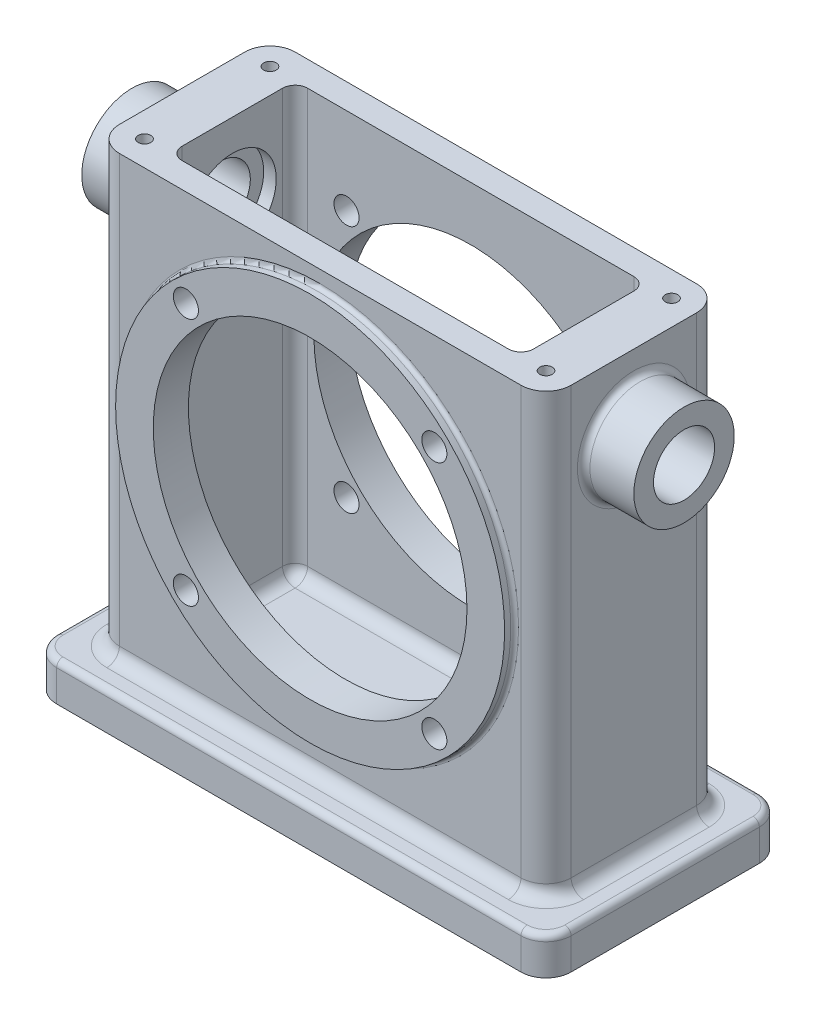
from build123d import *

# Parameters (mm, degrees)
SKETCH1_W                    = 130.175
SKETCH1_H                    = 60.325
BASE_EXTRUDE_DEPTH           = 9.525
SKETCH2_W                    = 114.3
SKETCH2_H                    = 44.45
BOSS_EXTRUDE1_DEPTH          = 111.125
FILLET1_R                    = 6.35
FILLET2_R                    = 1.5875
FILLET3_R                    = 3.175
CUT_EXTRUDE1_DEPTH           = 107.95
FILLET4_R                    = 3.175
SKETCH4_R                    = 49.2125
BOSS_EXTRUDE2_DEPTH          = 2.54
SKETCH5_R                    = 39.6875
CUT_EXTRUDE2_DEPTH           = 148.681533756
FILLET5_R                    = 0.9906
SKETCH6_R                    = 12.7
BOSS_EXTRUDE3_DEPTH          = 12.7
SKETCH7_R                    = 7.7343
CUT_EXTRUDE3_DEPTH           = 166.724659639
SKETCH8_R                    = 11.1125
CUT_EXTRUDE4_DEPTH           = 3.175
FILLET6_R                    = 1.5875
SKETCH9_R                    = 3.175
CUT_EXTRUDE5_DEPTH           = 150.841500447
CIRPATTERN1_COUNT            = 4
SKETCH10_R                   = 1.5875
CUT_EXTRUDE6_DEPTH           = 19.05
CUT_EXTRUDE6_DRAFT           = -2
CUT_EXTRUDE6_PROFILE_2_DEPTH = 19.05
CUT_EXTRUDE6_PROFILE_2_DRAFT = -2
MIRROR4_COPY_1_SKETCH_R      = 1.5875
MIRROR4_COPY_1_DEPTH         = 19.05
MIRROR4_COPY_1_DRAFT         = -2
MIRROR4_COPY_2_SKETCH_R      = 1.5875
MIRROR4_COPY_2_DEPTH         = 19.05
MIRROR4_COPY_2_DRAFT         = -2
MIRROR4_COPY_3_SKETCH_R      = 1.5875
MIRROR4_COPY_3_DEPTH         = 19.05
MIRROR4_COPY_3_DRAFT         = -2


with BuildPart() as part:
    # Sketch1 → Base-Extrude (new body)
    with BuildSketch(Plane(origin=(0, 0, 0), x_dir=(1, 0, 0), z_dir=(0, 1, 0))):
        Rectangle(SKETCH1_W, SKETCH1_H)
    extrude(amount=BASE_EXTRUDE_DEPTH)

    # Sketch2 → Boss-Extrude1 (add)
    with BuildSketch(Plane(origin=(0, 9.525, 0), x_dir=(-1, 0, 0), z_dir=(0, 1, 0))):
        Rectangle(SKETCH2_W, SKETCH2_H)
    extrude(amount=BOSS_EXTRUDE1_DEPTH)

    # Fillet1
    fillet1_edges = [part.edges().sort_by_distance(p)[0] for p in [
        (-57.15, 65.0875, -22.225),
        (-57.15, 65.0875, 22.225),
        (57.15, 65.0875, 22.225),
        (57.15, 65.0875, -22.225),
        (-65.0875, 4.7625, -30.1625),
        (65.0875, 4.7625, -30.1625),
        (65.0875, 4.7625, 30.1625),
        (-65.0875, 4.7625, 30.1625),
    ]]
    fillet(fillet1_edges, radius=FILLET1_R)

    # Fillet2
    fillet2_edges = [part.edges().sort_by_distance(p)[0] for p in [
        (0, 9.525, 30.1625),
        (-65.0875, 9.525, 0),
        (65.0875, 9.525, 0),
        (0, 9.525, -30.1625),
        (-63.227628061, 9.525, -28.302628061),
        (63.227628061, 9.525, 28.302628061),
        (63.227628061, 9.525, -28.302628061),
        (-63.227628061, 9.525, 28.302628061),
    ]]
    fillet(fillet2_edges, radius=FILLET2_R)

    # Fillet3
    fillet3_edges = [part.edges().sort_by_distance(p)[0] for p in [
        (-57.15, 9.525, 0),
        (0, 9.525, -22.225),
        (57.15, 9.525, 0),
        (0, 9.525, 22.225),
        (-55.290128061, 9.525, 20.365128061),
        (-55.290128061, 9.525, -20.365128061),
        (55.290128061, 9.525, 20.365128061),
        (55.290128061, 9.525, -20.365128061),
    ]]
    fillet(fillet3_edges, radius=FILLET3_R)

    # Sketch3 → Cut-Extrude1 (cut)
    with BuildSketch(Plane(origin=(0, 120.65, 0), x_dir=(-1, 0, 0), z_dir=(0, 1, 0))):
        with BuildLine():
            Line((41.275, 15.875), (-41.275, 15.875))
            ThreePointArc((-41.275, 15.875), (-43.52006403, 14.94506403), (-44.45, 12.7))
            Line((-44.45, 12.7), (-44.45, -12.7))
            ThreePointArc((-44.45, -12.7), (-43.52006403, -14.94506403), (-41.275, -15.875))
            Line((-41.275, -15.875), (41.275, -15.875))
            ThreePointArc((41.275, -15.875), (43.52006403, -14.94506403), (44.45, -12.7))
            Line((44.45, -12.7), (44.45, 12.7))
            ThreePointArc((44.45, 12.7), (43.52006403, 14.94506403), (41.275, 15.875))
        make_face()
    extrude(amount=-CUT_EXTRUDE1_DEPTH, mode=Mode.SUBTRACT)

    # Fillet4
    fillet4_edges = [part.edges().sort_by_distance(p)[0] for p in [
        (43.52006403, 12.7, 14.94506403),
        (0, 12.7, 15.875),
        (-43.52006403, 12.7, 14.94506403),
        (-44.45, 12.7, 0),
        (-43.52006403, 12.7, -14.94506403),
        (0, 12.7, -15.875),
        (43.52006403, 12.7, -14.94506403),
        (44.45, 12.7, 0),
    ]]
    fillet(fillet4_edges, radius=FILLET4_R)

    # Sketch4 → Boss-Extrude2 (add)
    with BuildSketch(Plane.XY.offset(22.225)):
        with Locations(Location((0, 67.31, 0), (0, 0, 180))):
            Circle(SKETCH4_R)
    boss_extrude2 = extrude(amount=BOSS_EXTRUDE2_DEPTH)

    # Mirror1: Boss-Extrude2 across plane
    add(boss_extrude2.mirror(Plane.XY))

    # Sketch5 → Cut-Extrude2 (cut, through all)
    with BuildSketch(Plane.XY.offset(24.765)):
        with Locations(Location((0, 67.31, 0), (0, 0, 180))):
            Circle(SKETCH5_R)
    extrude(amount=-CUT_EXTRUDE2_DEPTH, mode=Mode.SUBTRACT)

    # Fillet5
    fillet5_edges = [part.edges().sort_by_distance(p)[0] for p in [
        (49.2125, 67.31, 22.225),
        (49.2125, 67.31, -22.225),
    ]]
    fillet(fillet5_edges, radius=FILLET5_R)

    # Sketch6 → Boss-Extrude3 (add)
    with BuildSketch(Plane(origin=(57.15, 0, 0), x_dir=(0, 0, -1), z_dir=(1, 0, 0))):
        with Locations(Location((0, 101.6, 0), (0, 0, 180))):
            Circle(SKETCH6_R)
    boss_extrude3 = extrude(amount=BOSS_EXTRUDE3_DEPTH)

    # Sketch7 → Cut-Extrude3 (cut, through all)
    with BuildSketch(Plane.ZY.offset(-44.45)):
        with Locations((0, 101.6)):
            Circle(SKETCH7_R)
    cut_extrude3 = extrude(amount=-CUT_EXTRUDE3_DEPTH, mode=Mode.SUBTRACT)

    # Sketch8 → Cut-Extrude4 (cut)
    with BuildSketch(Plane.ZY.offset(-44.45)):
        with Locations((0, 101.6)):
            Circle(SKETCH8_R)
    cut_extrude4 = extrude(amount=-CUT_EXTRUDE4_DEPTH, mode=Mode.SUBTRACT)

    # Mirror3: Boss-Extrude3, Cut-Extrude3, Cut-Extrude4 across plane
    add(boss_extrude3.mirror(Plane(origin=(0, 0, 0), x_dir=(0, 0, 1), z_dir=(1, 0, 0))))
    add(cut_extrude3.mirror(Plane(origin=(0, 0, 0), x_dir=(0, 0, 1), z_dir=(1, 0, 0))), mode=Mode.SUBTRACT)
    add(cut_extrude4.mirror(Plane(origin=(0, 0, 0), x_dir=(0, 0, 1), z_dir=(1, 0, 0))), mode=Mode.SUBTRACT)

    # Fillet6
    fillet6_edges = [part.edges().sort_by_distance(p)[0] for p in [
        (57.15, 101.6, -12.7),
        (-57.15, 101.6, -12.7),
    ]]
    fillet(fillet6_edges, radius=FILLET6_R)

    # Sketch9 → Cut-Extrude5 (cut, through all)
    with BuildSketch(Plane.XY.offset(24.765)):
        with Locations(Location((31.430896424, 98.740896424, 0), (0, 0, 180))):
            Circle(SKETCH9_R)
    cut_extrude5 = extrude(amount=-CUT_EXTRUDE5_DEPTH, mode=Mode.SUBTRACT)

    # CirPattern1: Cut-Extrude5 ×4 about axis
    cirpattern1_axis = Axis((0, 67.31, 0), (0, 0, 1))
    for i in range(1, CIRPATTERN1_COUNT):
        add(cut_extrude5.rotate(cirpattern1_axis, i * 360 / CIRPATTERN1_COUNT), mode=Mode.SUBTRACT)


with BuildPart() as cut_extrude6_tool:
    # Sketch10 → Cut-Extrude6 (with draft: the straight prism first)
    with BuildSketch(Plane(origin=(0, 120.65, 0), x_dir=(-1, 0, 0), z_dir=(0, 1, 0))):
        with Locations((-50.8, -15.875)):
            Circle(SKETCH10_R)
    extrude(amount=-CUT_EXTRUDE6_DEPTH)
    # Cut-Extrude6: the draft: its side faces are tilted about the plane it starts from
    cut_extrude6_sides = [cut_extrude6_tool.faces().sort_by_distance(p)[0] for p in [
        (52.3875, 111.125, -15.875),
    ]]
    draft(cut_extrude6_sides, Plane(origin=(0, 120.65, 0), x_dir=(-1, 0, 0), z_dir=(0, 1, 0)), CUT_EXTRUDE6_DRAFT)


with BuildPart() as part_1:
    add(part.part)

    # Cut-Extrude6: cut by cut_extrude6_tool
    add(cut_extrude6_tool.part, mode=Mode.SUBTRACT)


with BuildPart() as cut_extrude6_profile_2_tool:
    # Sketch10 → Cut-Extrude6 profile 2 (with draft: the straight prism first)
    with BuildSketch(Plane(origin=(0, 120.65, 0), x_dir=(-1, 0, 0), z_dir=(0, 1, 0))):
        with Locations((-50.8, 15.875)):
            Circle(SKETCH10_R)
    extrude(amount=-CUT_EXTRUDE6_PROFILE_2_DEPTH)
    # Cut-Extrude6 profile 2: the draft: its side faces are tilted about the plane it starts from
    cut_extrude6_profile_2_sides = [cut_extrude6_profile_2_tool.faces().sort_by_distance(p)[0] for p in [
        (52.3875, 111.125, 15.875),
    ]]
    draft(cut_extrude6_profile_2_sides, Plane(origin=(0, 120.65, 0), x_dir=(-1, 0, 0), z_dir=(0, 1, 0)), CUT_EXTRUDE6_PROFILE_2_DRAFT)


with BuildPart() as part_2:
    add(part_1.part)

    # Cut-Extrude6 profile 2: cut by cut_extrude6_profile_2_tool
    add(cut_extrude6_profile_2_tool.part, mode=Mode.SUBTRACT)


with BuildPart() as mirror4_copy_1_tool:
    # Mirror4 copy 1 sketch → Mirror4 copy 1 (with draft: the straight prism first)
    with BuildSketch(Plane(origin=(0, 120.65, 0), x_dir=(1, 0, 0), z_dir=(0, 1, 0))):
        with Locations((-50.8, 15.875)):
            Circle(MIRROR4_COPY_1_SKETCH_R)
    extrude(amount=-MIRROR4_COPY_1_DEPTH)
    # Mirror4 copy 1: the draft: its side faces are tilted about the plane it starts from
    mirror4_copy_1_sides = [mirror4_copy_1_tool.faces().sort_by_distance(p)[0] for p in [
        (-52.3875, 111.125, -15.875),
    ]]
    draft(mirror4_copy_1_sides, Plane(origin=(0, 120.65, 0), x_dir=(1, 0, 0), z_dir=(0, 1, 0)), MIRROR4_COPY_1_DRAFT)


with BuildPart() as part_3:
    add(part_2.part)

    # Mirror4 copy 1: cut by mirror4_copy_1_tool
    add(mirror4_copy_1_tool.part, mode=Mode.SUBTRACT)


with BuildPart() as mirror4_copy_2_tool:
    # Mirror4 copy 2 sketch → Mirror4 copy 2 (with draft: the straight prism first)
    with BuildSketch(Plane(origin=(0, 120.65, 0), x_dir=(1, 0, 0), z_dir=(0, 1, 0))):
        with Locations((-50.8, -15.875)):
            Circle(MIRROR4_COPY_2_SKETCH_R)
    extrude(amount=-MIRROR4_COPY_2_DEPTH)
    # Mirror4 copy 2: the draft: its side faces are tilted about the plane it starts from
    mirror4_copy_2_sides = [mirror4_copy_2_tool.faces().sort_by_distance(p)[0] for p in [
        (-52.3875, 111.125, 15.875),
    ]]
    draft(mirror4_copy_2_sides, Plane(origin=(0, 120.65, 0), x_dir=(1, 0, 0), z_dir=(0, 1, 0)), MIRROR4_COPY_2_DRAFT)


with BuildPart() as part_4:
    add(part_3.part)

    # Mirror4 copy 2: cut by mirror4_copy_2_tool
    add(mirror4_copy_2_tool.part, mode=Mode.SUBTRACT)


with BuildPart() as mirror4_copy_3_tool:
    # Mirror4 copy 3 sketch → Mirror4 copy 3 (with draft: the straight prism first)
    with BuildSketch(Plane(origin=(0, 120.65, 0), x_dir=(1, 0, 0), z_dir=(0, 1, 0))):
        with Locations((-50.8, -15.875)):
            Circle(MIRROR4_COPY_3_SKETCH_R)
    extrude(amount=-MIRROR4_COPY_3_DEPTH)
    # Mirror4 copy 3: the draft: its side faces are tilted about the plane it starts from
    mirror4_copy_3_sides = [mirror4_copy_3_tool.faces().sort_by_distance(p)[0] for p in [
        (-52.3875, 111.125, 15.875),
    ]]
    draft(mirror4_copy_3_sides, Plane(origin=(0, 120.65, 0), x_dir=(1, 0, 0), z_dir=(0, 1, 0)), MIRROR4_COPY_3_DRAFT)


with BuildPart() as part_5:
    add(part_4.part)

    # Mirror4 copy 3: cut by mirror4_copy_3_tool
    add(mirror4_copy_3_tool.part, mode=Mode.SUBTRACT)


solid = part_5.part
